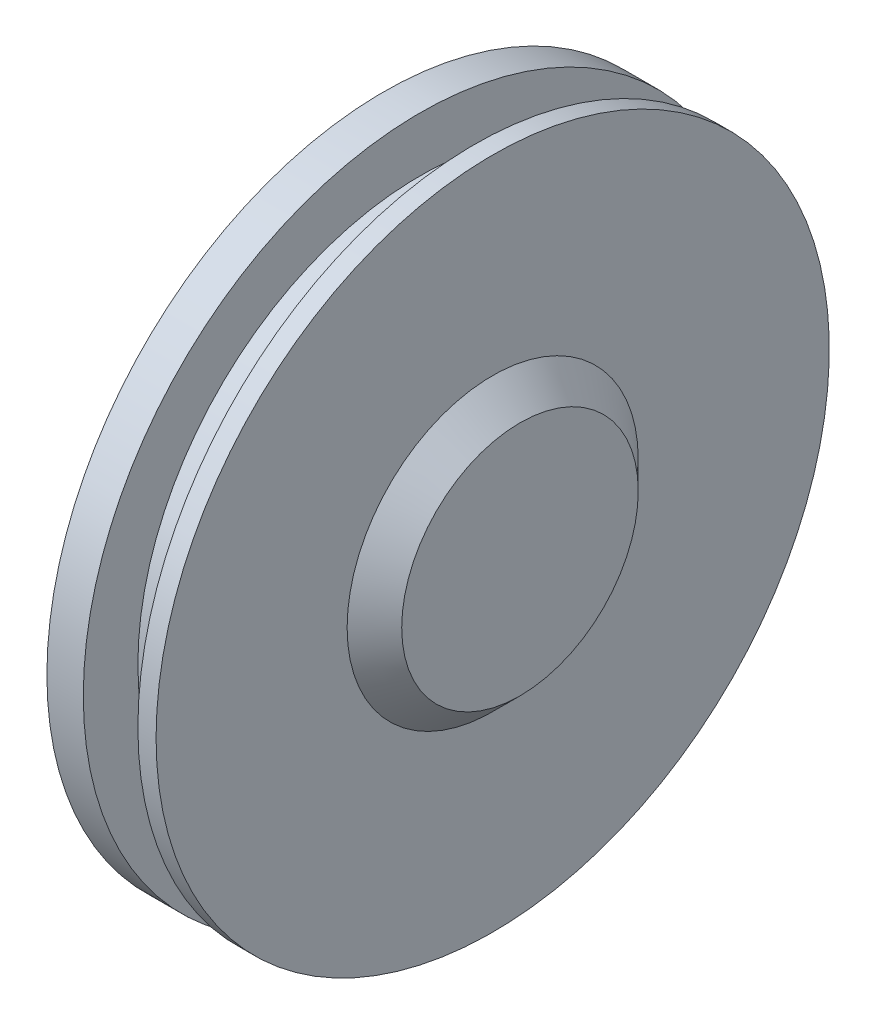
ISO-10303-21;
HEADER;
FILE_DESCRIPTION(('STEP AP214'),'2;1');
FILE_NAME('part.step','',(''),(''),'','','');
FILE_SCHEMA(('AUTOMOTIVE_DESIGN { 1 0 10303 214 1 1 1 1 }'));
ENDSEC;
DATA;
#1=APPLICATION_CONTEXT('core data for automotive mechanical design processes');
#2=APPLICATION_PROTOCOL_DEFINITION('international standard','automotive_design',2000,#1);
#3=PRODUCT_CONTEXT('',#1,'mechanical');
#4=PRODUCT('Part','Part','',(#3));
#5=PRODUCT_RELATED_PRODUCT_CATEGORY('part','',(#4));
#6=PRODUCT_DEFINITION_FORMATION('','',#4);
#7=PRODUCT_DEFINITION_CONTEXT('part definition',#1,'design');
#8=PRODUCT_DEFINITION('design','',#6,#7);
#9=PRODUCT_DEFINITION_SHAPE('','',#8);
#10=(LENGTH_UNIT() NAMED_UNIT(*) SI_UNIT(.MILLI.,.METRE.));
#11=(NAMED_UNIT(*) PLANE_ANGLE_UNIT() SI_UNIT($,.RADIAN.));
#12=(NAMED_UNIT(*) SI_UNIT($,.STERADIAN.) SOLID_ANGLE_UNIT());
#13=UNCERTAINTY_MEASURE_WITH_UNIT(LENGTH_MEASURE(1.E-05),#10,'distance_accuracy_value','');
#14=(GEOMETRIC_REPRESENTATION_CONTEXT(3) GLOBAL_UNCERTAINTY_ASSIGNED_CONTEXT((#13)) GLOBAL_UNIT_ASSIGNED_CONTEXT((#10,
#11,#12)) REPRESENTATION_CONTEXT('',''));
#15=CARTESIAN_POINT('',(0.,0.,0.));
#16=DIRECTION('',(0.,0.,1.));
#17=DIRECTION('',(1.,0.,0.));
#18=AXIS2_PLACEMENT_3D('',#15,#16,#17);
#19=CARTESIAN_POINT('',(-30.,41.5,0.));
#20=DIRECTION('',(-1.,0.,0.));
#21=DIRECTION('',(0.,0.,1.));
#22=AXIS2_PLACEMENT_3D('',#19,#20,#21);
#23=PLANE('',#22);
#24=CARTESIAN_POINT('',(-30.,41.5,0.));
#25=DIRECTION('',(-1.,0.,0.));
#26=DIRECTION('',(0.,0.,1.));
#27=AXIS2_PLACEMENT_3D('',#24,#25,#26);
#28=CIRCLE('',#27,18.5);
#29=CARTESIAN_POINT('',(-30.,41.5,18.5));
#30=VERTEX_POINT('',#29);
#31=EDGE_CURVE('E32',#30,#30,#28,.T.);
#32=ORIENTED_EDGE('',*,*,#31,.T.);
#33=EDGE_LOOP('',(#32));
#34=FACE_BOUND('',#33,.T.);
#35=ADVANCED_FACE('F22',(#34),#23,.T.);
#36=CARTESIAN_POINT('',(-34.3764194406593,41.5,0.));
#37=DIRECTION('',(-1.,0.,0.));
#38=DIRECTION('',(0.,0.,1.));
#39=AXIS2_PLACEMENT_3D('',#36,#37,#38);
#40=CYLINDRICAL_SURFACE('',#39,18.5);
#41=CARTESIAN_POINT('',(-28.,41.5,0.));
#42=DIRECTION('',(-1.,0.,0.));
#43=DIRECTION('',(0.,0.,1.));
#44=AXIS2_PLACEMENT_3D('',#41,#42,#43);
#45=CIRCLE('',#44,18.5);
#46=CARTESIAN_POINT('',(-28.,41.5,18.5));
#47=VERTEX_POINT('',#46);
#48=EDGE_CURVE('E37',#47,#47,#45,.T.);
#49=ORIENTED_EDGE('',*,*,#48,.T.);
#50=EDGE_LOOP('',(#49));
#51=FACE_BOUND('',#50,.T.);
#52=ORIENTED_EDGE('',*,*,#31,.F.);
#53=EDGE_LOOP('',(#52));
#54=FACE_BOUND('',#53,.T.);
#55=ADVANCED_FACE('F54',(#51,#54),#40,.T.);
#56=CARTESIAN_POINT('',(-28.,60.,0.));
#57=DIRECTION('',(1.,0.,0.));
#58=DIRECTION('',(0.,0.,-1.));
#59=AXIS2_PLACEMENT_3D('',#56,#57,#58);
#60=PLANE('',#59);
#61=CARTESIAN_POINT('',(-28.,41.5,0.));
#62=DIRECTION('',(-1.,0.,0.));
#63=DIRECTION('',(0.,0.,1.));
#64=AXIS2_PLACEMENT_3D('',#61,#62,#63);
#65=CIRCLE('',#64,15.5);
#66=CARTESIAN_POINT('',(-28.,41.5,15.5));
#67=VERTEX_POINT('',#66);
#68=EDGE_CURVE('E48',#67,#67,#65,.T.);
#69=ORIENTED_EDGE('',*,*,#68,.T.);
#70=EDGE_LOOP('',(#69));
#71=FACE_BOUND('',#70,.T.);
#72=ORIENTED_EDGE('',*,*,#48,.F.);
#73=EDGE_LOOP('',(#72));
#74=FACE_BOUND('',#73,.T.);
#75=ADVANCED_FACE('F57',(#71,#74),#60,.T.);
#76=CARTESIAN_POINT('',(-34.3764194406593,41.5,0.));
#77=DIRECTION('',(-1.,0.,0.));
#78=DIRECTION('',(0.,0.,1.));
#79=AXIS2_PLACEMENT_3D('',#76,#77,#78);
#80=CYLINDRICAL_SURFACE('',#79,15.5);
#81=CARTESIAN_POINT('',(-25.,41.5,0.));
#82=DIRECTION('',(-1.,0.,0.));
#83=DIRECTION('',(0.,0.,1.));
#84=AXIS2_PLACEMENT_3D('',#81,#82,#83);
#85=CIRCLE('',#84,15.5);
#86=CARTESIAN_POINT('',(-25.,41.5,15.5));
#87=VERTEX_POINT('',#86);
#88=EDGE_CURVE('E45',#87,#87,#85,.T.);
#89=ORIENTED_EDGE('',*,*,#88,.T.);
#90=EDGE_LOOP('',(#89));
#91=FACE_BOUND('',#90,.T.);
#92=ORIENTED_EDGE('',*,*,#68,.F.);
#93=EDGE_LOOP('',(#92));
#94=FACE_BOUND('',#93,.T.);
#95=ADVANCED_FACE('F59',(#91,#94),#80,.T.);
#96=CARTESIAN_POINT('',(-25.,57.,0.));
#97=DIRECTION('',(-1.,0.,0.));
#98=DIRECTION('',(0.,0.,1.));
#99=AXIS2_PLACEMENT_3D('',#96,#97,#98);
#100=PLANE('',#99);
#101=CARTESIAN_POINT('',(-25.,41.5,0.));
#102=DIRECTION('',(-1.,0.,0.));
#103=DIRECTION('',(0.,0.,1.));
#104=AXIS2_PLACEMENT_3D('',#101,#102,#103);
#105=CIRCLE('',#104,18.5);
#106=CARTESIAN_POINT('',(-25.,41.5,18.5));
#107=VERTEX_POINT('',#106);
#108=EDGE_CURVE('E42',#107,#107,#105,.T.);
#109=ORIENTED_EDGE('',*,*,#108,.T.);
#110=EDGE_LOOP('',(#109));
#111=FACE_BOUND('',#110,.T.);
#112=ORIENTED_EDGE('',*,*,#88,.F.);
#113=EDGE_LOOP('',(#112));
#114=FACE_BOUND('',#113,.T.);
#115=ADVANCED_FACE('F66',(#111,#114),#100,.T.);
#116=CARTESIAN_POINT('',(-34.3764194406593,41.5,0.));
#117=DIRECTION('',(-1.,0.,0.));
#118=DIRECTION('',(0.,0.,1.));
#119=AXIS2_PLACEMENT_3D('',#116,#117,#118);
#120=CYLINDRICAL_SURFACE('',#119,18.5);
#121=CARTESIAN_POINT('',(-24.,41.5,0.));
#122=DIRECTION('',(-1.,0.,0.));
#123=DIRECTION('',(0.,0.,1.));
#124=AXIS2_PLACEMENT_3D('',#121,#122,#123);
#125=CIRCLE('',#124,18.5);
#126=CARTESIAN_POINT('',(-24.,41.5,18.5));
#127=VERTEX_POINT('',#126);
#128=EDGE_CURVE('E39',#127,#127,#125,.T.);
#129=ORIENTED_EDGE('',*,*,#128,.T.);
#130=EDGE_LOOP('',(#129));
#131=FACE_BOUND('',#130,.T.);
#132=ORIENTED_EDGE('',*,*,#108,.F.);
#133=EDGE_LOOP('',(#132));
#134=FACE_BOUND('',#133,.T.);
#135=ADVANCED_FACE('F91',(#131,#134),#120,.T.);
#136=CARTESIAN_POINT('',(-24.,60.,0.));
#137=DIRECTION('',(1.,0.,0.));
#138=DIRECTION('',(0.,0.,-1.));
#139=AXIS2_PLACEMENT_3D('',#136,#137,#138);
#140=PLANE('',#139);
#141=CARTESIAN_POINT('',(-24.,41.5,0.));
#142=DIRECTION('',(1.,0.,0.));
#143=DIRECTION('',(0.,0.,-1.));
#144=AXIS2_PLACEMENT_3D('',#141,#142,#143);
#145=CIRCLE('',#144,8.);
#146=CARTESIAN_POINT('',(-24.,41.5,7.99999999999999));
#147=VERTEX_POINT('',#146);
#148=EDGE_CURVE('E28',#147,#147,#145,.T.);
#149=ORIENTED_EDGE('',*,*,#148,.F.);
#150=EDGE_LOOP('',(#149));
#151=FACE_BOUND('',#150,.T.);
#152=ORIENTED_EDGE('',*,*,#128,.F.);
#153=EDGE_LOOP('',(#152));
#154=FACE_BOUND('',#153,.T.);
#155=ADVANCED_FACE('F99',(#151,#154),#140,.T.);
#156=CARTESIAN_POINT('',(-22.5,41.5,0.));
#157=DIRECTION('',(1.,0.,0.));
#158=DIRECTION('',(0.,0.,-1.));
#159=AXIS2_PLACEMENT_3D('',#156,#157,#158);
#160=PLANE('',#159);
#161=CARTESIAN_POINT('',(-22.5,41.5,0.));
#162=DIRECTION('',(1.,0.,0.));
#163=DIRECTION('',(0.,0.,-1.));
#164=AXIS2_PLACEMENT_3D('',#161,#162,#163);
#165=CIRCLE('',#164,6.49999999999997);
#166=CARTESIAN_POINT('',(-22.5,41.5,6.49999999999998));
#167=VERTEX_POINT('',#166);
#168=EDGE_CURVE('E10',#167,#167,#165,.T.);
#169=ORIENTED_EDGE('',*,*,#168,.T.);
#170=EDGE_LOOP('',(#169));
#171=FACE_BOUND('',#170,.T.);
#172=ADVANCED_FACE('F107',(#171),#160,.T.);
#173=CARTESIAN_POINT('',(-22.5,41.5,0.));
#174=DIRECTION('',(-1.,0.,0.));
#175=DIRECTION('',(0.,0.,1.));
#176=AXIS2_PLACEMENT_3D('',#173,#174,#175);
#177=CONICAL_SURFACE('',#176,6.49999999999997,0.785398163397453);
#178=CARTESIAN_POINT('',(-24.,41.5,7.99999999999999));
#179=CARTESIAN_POINT('',(-23.984375,41.5,7.98437499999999));
#180=CARTESIAN_POINT('',(-23.96875,41.5,7.96874999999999));
#181=CARTESIAN_POINT('',(-23.9375,41.5,7.93749999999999));
#182=CARTESIAN_POINT('',(-23.921875,41.5,7.92187499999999));
#183=CARTESIAN_POINT('',(-23.890625,41.5,7.89062499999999));
#184=CARTESIAN_POINT('',(-23.875,41.5,7.87499999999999));
#185=CARTESIAN_POINT('',(-23.84375,41.5,7.84374999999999));
#186=CARTESIAN_POINT('',(-23.828125,41.5,7.82812499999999));
#187=CARTESIAN_POINT('',(-23.796875,41.5,7.79687499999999));
#188=CARTESIAN_POINT('',(-23.78125,41.5,7.78124999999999));
#189=CARTESIAN_POINT('',(-23.75,41.5,7.74999999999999));
#190=CARTESIAN_POINT('',(-23.734375,41.5,7.73437499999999));
#191=CARTESIAN_POINT('',(-23.703125,41.5,7.70312499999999));
#192=CARTESIAN_POINT('',(-23.6875,41.5,7.68749999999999));
#193=CARTESIAN_POINT('',(-23.65625,41.5,7.65624999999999));
#194=CARTESIAN_POINT('',(-23.640625,41.5,7.64062499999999));
#195=CARTESIAN_POINT('',(-23.609375,41.5,7.60937499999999));
#196=CARTESIAN_POINT('',(-23.59375,41.5,7.59374999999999));
#197=CARTESIAN_POINT('',(-23.5625,41.5,7.56249999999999));
#198=CARTESIAN_POINT('',(-23.546875,41.5,7.54687499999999));
#199=CARTESIAN_POINT('',(-23.515625,41.5,7.51562499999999));
#200=CARTESIAN_POINT('',(-23.5,41.5,7.49999999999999));
#201=CARTESIAN_POINT('',(-23.46875,41.5,7.46874999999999));
#202=CARTESIAN_POINT('',(-23.453125,41.5,7.45312499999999));
#203=CARTESIAN_POINT('',(-23.421875,41.5,7.42187499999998));
#204=CARTESIAN_POINT('',(-23.40625,41.5,7.40624999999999));
#205=CARTESIAN_POINT('',(-23.375,41.5,7.37499999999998));
#206=CARTESIAN_POINT('',(-23.359375,41.5,7.35937499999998));
#207=CARTESIAN_POINT('',(-23.328125,41.5,7.32812499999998));
#208=CARTESIAN_POINT('',(-23.3125,41.5,7.31249999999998));
#209=CARTESIAN_POINT('',(-23.28125,41.5,7.28124999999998));
#210=CARTESIAN_POINT('',(-23.265625,41.5,7.26562499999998));
#211=CARTESIAN_POINT('',(-23.234375,41.5,7.23437499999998));
#212=CARTESIAN_POINT('',(-23.21875,41.5,7.21874999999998));
#213=CARTESIAN_POINT('',(-23.1875,41.5,7.18749999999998));
#214=CARTESIAN_POINT('',(-23.171875,41.5,7.17187499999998));
#215=CARTESIAN_POINT('',(-23.140625,41.5,7.14062499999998));
#216=CARTESIAN_POINT('',(-23.125,41.5,7.12499999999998));
#217=CARTESIAN_POINT('',(-23.09375,41.5,7.09374999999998));
#218=CARTESIAN_POINT('',(-23.078125,41.5,7.07812499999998));
#219=CARTESIAN_POINT('',(-23.046875,41.5,7.04687499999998));
#220=CARTESIAN_POINT('',(-23.03125,41.5,7.03124999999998));
#221=CARTESIAN_POINT('',(-23.,41.5,6.99999999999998));
#222=CARTESIAN_POINT('',(-22.984375,41.5,6.98437499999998));
#223=CARTESIAN_POINT('',(-22.953125,41.5,6.95312499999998));
#224=CARTESIAN_POINT('',(-22.9375,41.5,6.93749999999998));
#225=CARTESIAN_POINT('',(-22.90625,41.5,6.90624999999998));
#226=CARTESIAN_POINT('',(-22.890625,41.5,6.89062499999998));
#227=CARTESIAN_POINT('',(-22.859375,41.5,6.85937499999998));
#228=CARTESIAN_POINT('',(-22.84375,41.5,6.84374999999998));
#229=CARTESIAN_POINT('',(-22.8125,41.5,6.81249999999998));
#230=CARTESIAN_POINT('',(-22.796875,41.5,6.79687499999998));
#231=CARTESIAN_POINT('',(-22.765625,41.5,6.76562499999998));
#232=CARTESIAN_POINT('',(-22.75,41.5,6.74999999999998));
#233=CARTESIAN_POINT('',(-22.71875,41.5,6.71874999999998));
#234=CARTESIAN_POINT('',(-22.703125,41.5,6.70312499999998));
#235=CARTESIAN_POINT('',(-22.671875,41.5,6.67187499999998));
#236=CARTESIAN_POINT('',(-22.65625,41.5,6.65624999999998));
#237=CARTESIAN_POINT('',(-22.625,41.5,6.62499999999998));
#238=CARTESIAN_POINT('',(-22.609375,41.5,6.60937499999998));
#239=CARTESIAN_POINT('',(-22.578125,41.5,6.57812499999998));
#240=CARTESIAN_POINT('',(-22.5625,41.5,6.56249999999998));
#241=CARTESIAN_POINT('',(-22.53125,41.5,6.53124999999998));
#242=CARTESIAN_POINT('',(-22.515625,41.5,6.51562499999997));
#243=CARTESIAN_POINT('',(-22.5,41.5,6.49999999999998));
#244=B_SPLINE_CURVE_WITH_KNOTS('',3,(#178,#179,#180,#181,#182,#183,#184,#185,#186,#187,#188,
#189,#190,#191,#192,#193,#194,#195,#196,#197,#198,#199,#200,#201,#202,#203,#204,#205,#206,#207,
#208,#209,#210,#211,#212,#213,#214,#215,#216,#217,#218,#219,#220,#221,#222,#223,#224,#225,#226,
#227,#228,#229,#230,#231,#232,#233,#234,#235,#236,#237,#238,#239,#240,#241,#242,#243),
.UNSPECIFIED.,.F.,.F.,(4,2,2,2,2,2,2,2,2,2,2,2,2,2,2,2,2,2,2,2,2,2,2,2,2,2,2,2,2,2,2,2,4),(0.,
0.0662912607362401,0.132582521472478,0.198873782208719,0.265165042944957,0.331456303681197,
0.397747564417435,0.464038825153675,0.530330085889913,0.596621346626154,0.662912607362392,
0.729203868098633,0.79549512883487,0.861786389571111,0.928077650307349,0.994368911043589,
1.06066017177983,1.12695143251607,1.19324269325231,1.25953395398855,1.32582521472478,
1.39211647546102,1.45840773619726,1.5246989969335,1.59099025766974,1.65728151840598,
1.72357277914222,1.78986403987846,1.8561553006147,1.92244656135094,1.98873782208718,
2.05502908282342,2.12132034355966),.UNSPECIFIED.);
#245=EDGE_CURVE('BSEAM115',#147,#167,#244,.T.);
#246=ORIENTED_EDGE('',*,*,#148,.T.);
#247=ORIENTED_EDGE('',*,*,#168,.F.);
#248=ORIENTED_EDGE('',*,*,#245,.T.);
#249=ORIENTED_EDGE('',*,*,#245,.F.);
#250=EDGE_LOOP('',(#246,#248,#247,#249));
#251=FACE_BOUND('',#250,.T.);
#252=ADVANCED_FACE('F115',(#251),#177,.T.);
#253=CLOSED_SHELL('',(#35,#55,#75,#95,#115,#135,#155,#172,#252));
#254=MANIFOLD_SOLID_BREP('B2',#253);
#255=ADVANCED_BREP_SHAPE_REPRESENTATION('',(#18,#254),#14);
#256=SHAPE_DEFINITION_REPRESENTATION(#9,#255);
ENDSEC;
END-ISO-10303-21;
